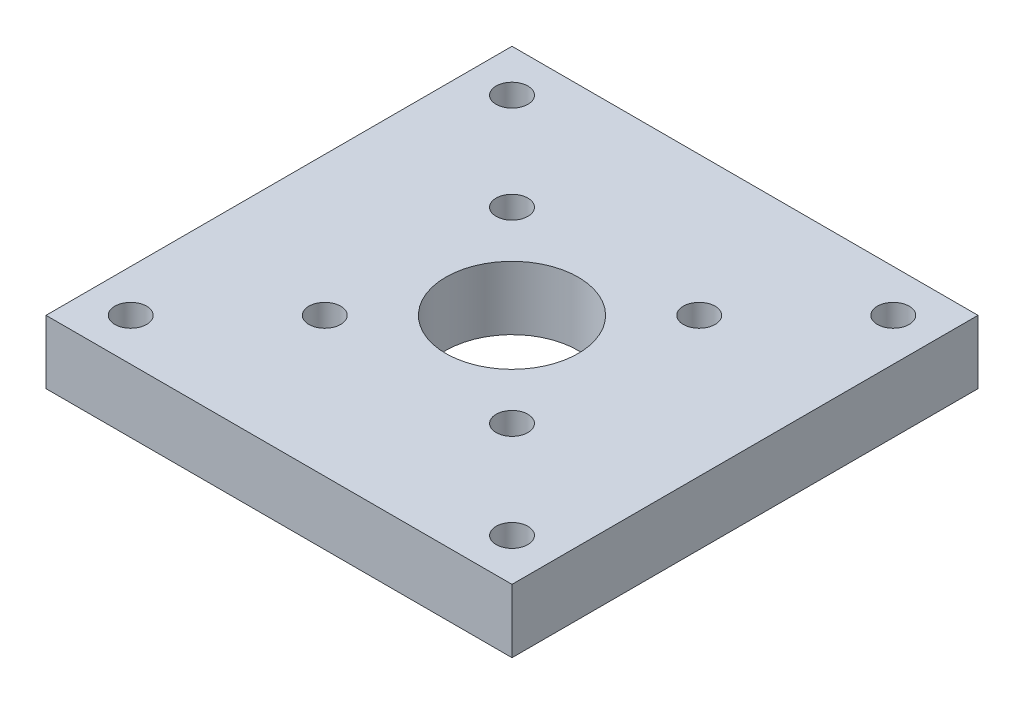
ISO-10303-21;
HEADER;
FILE_DESCRIPTION(('STEP AP214'),'2;1');
FILE_NAME('part.step','',(''),(''),'','','');
FILE_SCHEMA(('AUTOMOTIVE_DESIGN { 1 0 10303 214 1 1 1 1 }'));
ENDSEC;
DATA;
#1=APPLICATION_CONTEXT('core data for automotive mechanical design processes');
#2=APPLICATION_PROTOCOL_DEFINITION('international standard','automotive_design',2000,#1);
#3=PRODUCT_CONTEXT('',#1,'mechanical');
#4=PRODUCT('Part','Part','',(#3));
#5=PRODUCT_RELATED_PRODUCT_CATEGORY('part','',(#4));
#6=PRODUCT_DEFINITION_FORMATION('','',#4);
#7=PRODUCT_DEFINITION_CONTEXT('part definition',#1,'design');
#8=PRODUCT_DEFINITION('design','',#6,#7);
#9=PRODUCT_DEFINITION_SHAPE('','',#8);
#10=(LENGTH_UNIT() NAMED_UNIT(*) SI_UNIT(.MILLI.,.METRE.));
#11=(NAMED_UNIT(*) PLANE_ANGLE_UNIT() SI_UNIT($,.RADIAN.));
#12=(NAMED_UNIT(*) SI_UNIT($,.STERADIAN.) SOLID_ANGLE_UNIT());
#13=UNCERTAINTY_MEASURE_WITH_UNIT(LENGTH_MEASURE(1.E-05),#10,'distance_accuracy_value','');
#14=(GEOMETRIC_REPRESENTATION_CONTEXT(3) GLOBAL_UNCERTAINTY_ASSIGNED_CONTEXT((#13)) GLOBAL_UNIT_ASSIGNED_CONTEXT((#10,
#11,#12)) REPRESENTATION_CONTEXT('',''));
#15=CARTESIAN_POINT('',(0.,0.,0.));
#16=DIRECTION('',(0.,0.,1.));
#17=DIRECTION('',(1.,0.,0.));
#18=AXIS2_PLACEMENT_3D('',#15,#16,#17);
#19=CARTESIAN_POINT('',(0.,0.,0.));
#20=DIRECTION('',(0.,1.,0.));
#21=DIRECTION('',(1.,0.,0.));
#22=AXIS2_PLACEMENT_3D('',#19,#20,#21);
#23=PLANE('',#22);
#24=CARTESIAN_POINT('',(18.,0.,-18.));
#25=DIRECTION('',(0.,-1.,0.));
#26=DIRECTION('',(1.,0.,0.));
#27=AXIS2_PLACEMENT_3D('',#24,#25,#26);
#28=CIRCLE('',#27,1.5);
#29=CARTESIAN_POINT('',(16.5,0.,-18.));
#30=VERTEX_POINT('',#29);
#31=EDGE_CURVE('E154',#30,#30,#28,.T.);
#32=ORIENTED_EDGE('',*,*,#31,.F.);
#33=EDGE_LOOP('',(#32));
#34=FACE_BOUND('',#33,.T.);
#35=CARTESIAN_POINT('',(-18.,0.,-18.));
#36=DIRECTION('',(0.,-1.,0.));
#37=DIRECTION('',(1.,0.,0.));
#38=AXIS2_PLACEMENT_3D('',#35,#36,#37);
#39=CIRCLE('',#38,1.5);
#40=CARTESIAN_POINT('',(-19.5,0.,-18.));
#41=VERTEX_POINT('',#40);
#42=EDGE_CURVE('E179',#41,#41,#39,.T.);
#43=ORIENTED_EDGE('',*,*,#42,.F.);
#44=EDGE_LOOP('',(#43));
#45=FACE_BOUND('',#44,.T.);
#46=CARTESIAN_POINT('',(-18.,0.,18.));
#47=DIRECTION('',(0.,-1.,0.));
#48=DIRECTION('',(1.,0.,0.));
#49=AXIS2_PLACEMENT_3D('',#46,#47,#48);
#50=CIRCLE('',#49,1.5);
#51=CARTESIAN_POINT('',(-19.5,0.,18.));
#52=VERTEX_POINT('',#51);
#53=EDGE_CURVE('E131',#52,#52,#50,.T.);
#54=ORIENTED_EDGE('',*,*,#53,.F.);
#55=EDGE_LOOP('',(#54));
#56=FACE_BOUND('',#55,.T.);
#57=CARTESIAN_POINT('',(-8.83883476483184,0.,-8.83883476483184));
#58=DIRECTION('',(0.,-1.,0.));
#59=DIRECTION('',(1.,0.,0.));
#60=AXIS2_PLACEMENT_3D('',#57,#58,#59);
#61=CIRCLE('',#60,1.5);
#62=CARTESIAN_POINT('',(-10.3388347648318,0.,-8.83883476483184));
#63=VERTEX_POINT('',#62);
#64=EDGE_CURVE('E158',#63,#63,#61,.T.);
#65=ORIENTED_EDGE('',*,*,#64,.F.);
#66=EDGE_LOOP('',(#65));
#67=FACE_BOUND('',#66,.T.);
#68=CARTESIAN_POINT('',(-8.83883476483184,0.,8.83883476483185));
#69=DIRECTION('',(0.,-1.,0.));
#70=DIRECTION('',(1.,0.,0.));
#71=AXIS2_PLACEMENT_3D('',#68,#69,#70);
#72=CIRCLE('',#71,1.5);
#73=CARTESIAN_POINT('',(-10.3388347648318,0.,8.83883476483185));
#74=VERTEX_POINT('',#73);
#75=EDGE_CURVE('E189',#74,#74,#72,.T.);
#76=ORIENTED_EDGE('',*,*,#75,.F.);
#77=EDGE_LOOP('',(#76));
#78=FACE_BOUND('',#77,.T.);
#79=CARTESIAN_POINT('',(8.83883476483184,0.,8.83883476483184));
#80=DIRECTION('',(0.,-1.,0.));
#81=DIRECTION('',(1.,0.,0.));
#82=AXIS2_PLACEMENT_3D('',#79,#80,#81);
#83=CIRCLE('',#82,1.5);
#84=CARTESIAN_POINT('',(7.33883476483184,0.,8.83883476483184));
#85=VERTEX_POINT('',#84);
#86=EDGE_CURVE('E465',#85,#85,#83,.T.);
#87=ORIENTED_EDGE('',*,*,#86,.F.);
#88=EDGE_LOOP('',(#87));
#89=FACE_BOUND('',#88,.T.);
#90=CARTESIAN_POINT('',(8.83883476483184,0.,-8.83883476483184));
#91=DIRECTION('',(0.,-1.,0.));
#92=DIRECTION('',(1.,0.,0.));
#93=AXIS2_PLACEMENT_3D('',#90,#91,#92);
#94=CIRCLE('',#93,1.5);
#95=CARTESIAN_POINT('',(7.33883476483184,0.,-8.83883476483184));
#96=VERTEX_POINT('',#95);
#97=EDGE_CURVE('E198',#96,#96,#94,.T.);
#98=ORIENTED_EDGE('',*,*,#97,.F.);
#99=EDGE_LOOP('',(#98));
#100=FACE_BOUND('',#99,.T.);
#101=CARTESIAN_POINT('',(0.,0.,0.));
#102=DIRECTION('',(0.,-1.,0.));
#103=DIRECTION('',(1.,0.,0.));
#104=AXIS2_PLACEMENT_3D('',#101,#102,#103);
#105=CIRCLE('',#104,6.25);
#106=CARTESIAN_POINT('',(-6.25,0.,0.));
#107=VERTEX_POINT('',#106);
#108=EDGE_CURVE('E170',#107,#107,#105,.T.);
#109=ORIENTED_EDGE('',*,*,#108,.F.);
#110=EDGE_LOOP('',(#109));
#111=FACE_BOUND('',#110,.T.);
#112=CARTESIAN_POINT('',(18.,0.,18.));
#113=DIRECTION('',(0.,-1.,0.));
#114=DIRECTION('',(1.,0.,0.));
#115=AXIS2_PLACEMENT_3D('',#112,#113,#114);
#116=CIRCLE('',#115,1.5);
#117=CARTESIAN_POINT('',(16.5,0.,18.));
#118=VERTEX_POINT('',#117);
#119=EDGE_CURVE('E183',#118,#118,#116,.T.);
#120=ORIENTED_EDGE('',*,*,#119,.F.);
#121=EDGE_LOOP('',(#120));
#122=FACE_BOUND('',#121,.T.);
#123=DIRECTION('',(0.,0.,-1.));
#124=VECTOR('',#123,1.);
#125=CARTESIAN_POINT('',(22.,0.,22.));
#126=LINE('',#125,#124);
#127=CARTESIAN_POINT('',(22.,0.,22.));
#128=VERTEX_POINT('',#127);
#129=CARTESIAN_POINT('',(22.,0.,-22.));
#130=VERTEX_POINT('',#129);
#131=EDGE_CURVE('E28',#128,#130,#126,.T.);
#132=ORIENTED_EDGE('',*,*,#131,.F.);
#133=DIRECTION('',(1.,0.,0.));
#134=VECTOR('',#133,1.);
#135=CARTESIAN_POINT('',(-22.,0.,22.));
#136=LINE('',#135,#134);
#137=CARTESIAN_POINT('',(-22.,0.,22.));
#138=VERTEX_POINT('',#137);
#139=EDGE_CURVE('E21',#138,#128,#136,.T.);
#140=ORIENTED_EDGE('',*,*,#139,.F.);
#141=DIRECTION('',(0.,0.,1.));
#142=VECTOR('',#141,1.);
#143=CARTESIAN_POINT('',(-22.,0.,-22.));
#144=LINE('',#143,#142);
#145=CARTESIAN_POINT('',(-22.,0.,-22.));
#146=VERTEX_POINT('',#145);
#147=EDGE_CURVE('E232',#146,#138,#144,.T.);
#148=ORIENTED_EDGE('',*,*,#147,.F.);
#149=DIRECTION('',(-1.,0.,0.));
#150=VECTOR('',#149,1.);
#151=CARTESIAN_POINT('',(22.,0.,-22.));
#152=LINE('',#151,#150);
#153=EDGE_CURVE('E208',#130,#146,#152,.T.);
#154=ORIENTED_EDGE('',*,*,#153,.F.);
#155=EDGE_LOOP('',(#132,#140,#148,#154));
#156=FACE_BOUND('',#155,.T.);
#157=ADVANCED_FACE('F17',(#34,#45,#56,#67,#78,#89,#100,#111,#122,#156),#23,.F.);
#158=CARTESIAN_POINT('',(0.,6.,0.));
#159=DIRECTION('',(0.,1.,0.));
#160=DIRECTION('',(1.,0.,0.));
#161=AXIS2_PLACEMENT_3D('',#158,#159,#160);
#162=PLANE('',#161);
#163=CARTESIAN_POINT('',(18.,6.,-18.));
#164=DIRECTION('',(0.,-1.,0.));
#165=DIRECTION('',(1.,0.,0.));
#166=AXIS2_PLACEMENT_3D('',#163,#164,#165);
#167=CIRCLE('',#166,1.5);
#168=CARTESIAN_POINT('',(16.5,6.,-18.));
#169=VERTEX_POINT('',#168);
#170=EDGE_CURVE('E162',#169,#169,#167,.T.);
#171=ORIENTED_EDGE('',*,*,#170,.T.);
#172=EDGE_LOOP('',(#171));
#173=FACE_BOUND('',#172,.T.);
#174=CARTESIAN_POINT('',(-18.,6.,-18.));
#175=DIRECTION('',(0.,-1.,0.));
#176=DIRECTION('',(1.,0.,0.));
#177=AXIS2_PLACEMENT_3D('',#174,#175,#176);
#178=CIRCLE('',#177,1.5);
#179=CARTESIAN_POINT('',(-19.5,6.,-18.));
#180=VERTEX_POINT('',#179);
#181=EDGE_CURVE('E156',#180,#180,#178,.T.);
#182=ORIENTED_EDGE('',*,*,#181,.T.);
#183=EDGE_LOOP('',(#182));
#184=FACE_BOUND('',#183,.T.);
#185=CARTESIAN_POINT('',(-18.,6.,18.));
#186=DIRECTION('',(0.,-1.,0.));
#187=DIRECTION('',(1.,0.,0.));
#188=AXIS2_PLACEMENT_3D('',#185,#186,#187);
#189=CIRCLE('',#188,1.5);
#190=CARTESIAN_POINT('',(-19.5,6.,18.));
#191=VERTEX_POINT('',#190);
#192=EDGE_CURVE('E148',#191,#191,#189,.T.);
#193=ORIENTED_EDGE('',*,*,#192,.T.);
#194=EDGE_LOOP('',(#193));
#195=FACE_BOUND('',#194,.T.);
#196=CARTESIAN_POINT('',(-8.83883476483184,6.,-8.83883476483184));
#197=DIRECTION('',(0.,-1.,0.));
#198=DIRECTION('',(1.,0.,0.));
#199=AXIS2_PLACEMENT_3D('',#196,#197,#198);
#200=CIRCLE('',#199,1.5);
#201=CARTESIAN_POINT('',(-10.3388347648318,6.,-8.83883476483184));
#202=VERTEX_POINT('',#201);
#203=EDGE_CURVE('E138',#202,#202,#200,.T.);
#204=ORIENTED_EDGE('',*,*,#203,.T.);
#205=EDGE_LOOP('',(#204));
#206=FACE_BOUND('',#205,.T.);
#207=CARTESIAN_POINT('',(-8.83883476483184,6.,8.83883476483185));
#208=DIRECTION('',(0.,-1.,0.));
#209=DIRECTION('',(1.,0.,0.));
#210=AXIS2_PLACEMENT_3D('',#207,#208,#209);
#211=CIRCLE('',#210,1.5);
#212=CARTESIAN_POINT('',(-10.3388347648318,6.,8.83883476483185));
#213=VERTEX_POINT('',#212);
#214=EDGE_CURVE('E161',#213,#213,#211,.T.);
#215=ORIENTED_EDGE('',*,*,#214,.T.);
#216=EDGE_LOOP('',(#215));
#217=FACE_BOUND('',#216,.T.);
#218=CARTESIAN_POINT('',(8.83883476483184,6.,8.83883476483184));
#219=DIRECTION('',(0.,-1.,0.));
#220=DIRECTION('',(1.,0.,0.));
#221=AXIS2_PLACEMENT_3D('',#218,#219,#220);
#222=CIRCLE('',#221,1.5);
#223=CARTESIAN_POINT('',(7.33883476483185,6.,8.83883476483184));
#224=VERTEX_POINT('',#223);
#225=EDGE_CURVE('E192',#224,#224,#222,.T.);
#226=ORIENTED_EDGE('',*,*,#225,.T.);
#227=EDGE_LOOP('',(#226));
#228=FACE_BOUND('',#227,.T.);
#229=CARTESIAN_POINT('',(8.83883476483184,6.,-8.83883476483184));
#230=DIRECTION('',(0.,-1.,0.));
#231=DIRECTION('',(1.,0.,0.));
#232=AXIS2_PLACEMENT_3D('',#229,#230,#231);
#233=CIRCLE('',#232,1.5);
#234=CARTESIAN_POINT('',(7.33883476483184,6.,-8.83883476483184));
#235=VERTEX_POINT('',#234);
#236=EDGE_CURVE('E152',#235,#235,#233,.T.);
#237=ORIENTED_EDGE('',*,*,#236,.T.);
#238=EDGE_LOOP('',(#237));
#239=FACE_BOUND('',#238,.T.);
#240=CARTESIAN_POINT('',(0.,6.,0.));
#241=DIRECTION('',(0.,-1.,0.));
#242=DIRECTION('',(1.,0.,0.));
#243=AXIS2_PLACEMENT_3D('',#240,#241,#242);
#244=CIRCLE('',#243,6.25);
#245=CARTESIAN_POINT('',(-6.25,6.,0.));
#246=VERTEX_POINT('',#245);
#247=EDGE_CURVE('E171',#246,#246,#244,.T.);
#248=ORIENTED_EDGE('',*,*,#247,.T.);
#249=EDGE_LOOP('',(#248));
#250=FACE_BOUND('',#249,.T.);
#251=CARTESIAN_POINT('',(18.,6.,18.));
#252=DIRECTION('',(0.,-1.,0.));
#253=DIRECTION('',(1.,0.,0.));
#254=AXIS2_PLACEMENT_3D('',#251,#252,#253);
#255=CIRCLE('',#254,1.5);
#256=CARTESIAN_POINT('',(16.5,6.,18.));
#257=VERTEX_POINT('',#256);
#258=EDGE_CURVE('E253',#257,#257,#255,.T.);
#259=ORIENTED_EDGE('',*,*,#258,.T.);
#260=EDGE_LOOP('',(#259));
#261=FACE_BOUND('',#260,.T.);
#262=DIRECTION('',(0.,0.,-1.));
#263=VECTOR('',#262,1.);
#264=CARTESIAN_POINT('',(22.,6.,22.));
#265=LINE('',#264,#263);
#266=CARTESIAN_POINT('',(22.,6.,22.));
#267=VERTEX_POINT('',#266);
#268=CARTESIAN_POINT('',(22.,6.,-22.));
#269=VERTEX_POINT('',#268);
#270=EDGE_CURVE('E11',#267,#269,#265,.T.);
#271=ORIENTED_EDGE('',*,*,#270,.T.);
#272=DIRECTION('',(-1.,0.,0.));
#273=VECTOR('',#272,1.);
#274=CARTESIAN_POINT('',(22.,6.,-22.));
#275=LINE('',#274,#273);
#276=CARTESIAN_POINT('',(-22.,6.,-22.));
#277=VERTEX_POINT('',#276);
#278=EDGE_CURVE('E210',#269,#277,#275,.T.);
#279=ORIENTED_EDGE('',*,*,#278,.T.);
#280=DIRECTION('',(0.,0.,1.));
#281=VECTOR('',#280,1.);
#282=CARTESIAN_POINT('',(-22.,6.,-22.));
#283=LINE('',#282,#281);
#284=CARTESIAN_POINT('',(-22.,6.,22.));
#285=VERTEX_POINT('',#284);
#286=EDGE_CURVE('E209',#277,#285,#283,.T.);
#287=ORIENTED_EDGE('',*,*,#286,.T.);
#288=DIRECTION('',(1.,0.,0.));
#289=VECTOR('',#288,1.);
#290=CARTESIAN_POINT('',(-22.,6.,22.));
#291=LINE('',#290,#289);
#292=EDGE_CURVE('E199',#285,#267,#291,.T.);
#293=ORIENTED_EDGE('',*,*,#292,.T.);
#294=EDGE_LOOP('',(#271,#279,#287,#293));
#295=FACE_BOUND('',#294,.T.);
#296=ADVANCED_FACE('F226',(#173,#184,#195,#206,#217,#228,#239,#250,#261,#295),#162,.T.);
#297=CARTESIAN_POINT('',(22.,0.,22.));
#298=DIRECTION('',(1.,0.,0.));
#299=DIRECTION('',(0.,1.,0.));
#300=AXIS2_PLACEMENT_3D('',#297,#298,#299);
#301=PLANE('',#300);
#302=ORIENTED_EDGE('',*,*,#131,.T.);
#303=DIRECTION('',(0.,1.,0.));
#304=VECTOR('',#303,1.);
#305=CARTESIAN_POINT('',(22.,0.,-22.));
#306=LINE('',#305,#304);
#307=EDGE_CURVE('E181',#130,#269,#306,.T.);
#308=ORIENTED_EDGE('',*,*,#307,.T.);
#309=ORIENTED_EDGE('',*,*,#270,.F.);
#310=DIRECTION('',(0.,1.,0.));
#311=VECTOR('',#310,1.);
#312=CARTESIAN_POINT('',(22.,0.,22.));
#313=LINE('',#312,#311);
#314=EDGE_CURVE('E203',#128,#267,#313,.T.);
#315=ORIENTED_EDGE('',*,*,#314,.F.);
#316=EDGE_LOOP('',(#302,#308,#309,#315));
#317=FACE_BOUND('',#316,.T.);
#318=ADVANCED_FACE('F218',(#317),#301,.T.);
#319=CARTESIAN_POINT('',(22.,0.,-22.));
#320=DIRECTION('',(0.,0.,-1.));
#321=DIRECTION('',(-1.,0.,0.));
#322=AXIS2_PLACEMENT_3D('',#319,#320,#321);
#323=PLANE('',#322);
#324=ORIENTED_EDGE('',*,*,#153,.T.);
#325=DIRECTION('',(0.,1.,0.));
#326=VECTOR('',#325,1.);
#327=CARTESIAN_POINT('',(-22.,0.,-22.));
#328=LINE('',#327,#326);
#329=EDGE_CURVE('E204',#146,#277,#328,.T.);
#330=ORIENTED_EDGE('',*,*,#329,.T.);
#331=ORIENTED_EDGE('',*,*,#278,.F.);
#332=ORIENTED_EDGE('',*,*,#307,.F.);
#333=EDGE_LOOP('',(#324,#330,#331,#332));
#334=FACE_BOUND('',#333,.T.);
#335=ADVANCED_FACE('F223',(#334),#323,.T.);
#336=CARTESIAN_POINT('',(-22.,0.,-22.));
#337=DIRECTION('',(-1.,0.,0.));
#338=DIRECTION('',(0.,1.,0.));
#339=AXIS2_PLACEMENT_3D('',#336,#337,#338);
#340=PLANE('',#339);
#341=ORIENTED_EDGE('',*,*,#147,.T.);
#342=DIRECTION('',(0.,1.,0.));
#343=VECTOR('',#342,1.);
#344=CARTESIAN_POINT('',(-22.,0.,22.));
#345=LINE('',#344,#343);
#346=EDGE_CURVE('E202',#138,#285,#345,.T.);
#347=ORIENTED_EDGE('',*,*,#346,.T.);
#348=ORIENTED_EDGE('',*,*,#286,.F.);
#349=ORIENTED_EDGE('',*,*,#329,.F.);
#350=EDGE_LOOP('',(#341,#347,#348,#349));
#351=FACE_BOUND('',#350,.T.);
#352=ADVANCED_FACE('F236',(#351),#340,.T.);
#353=CARTESIAN_POINT('',(-22.,0.,22.));
#354=DIRECTION('',(0.,0.,1.));
#355=DIRECTION('',(1.,0.,0.));
#356=AXIS2_PLACEMENT_3D('',#353,#354,#355);
#357=PLANE('',#356);
#358=ORIENTED_EDGE('',*,*,#139,.T.);
#359=ORIENTED_EDGE('',*,*,#314,.T.);
#360=ORIENTED_EDGE('',*,*,#292,.F.);
#361=ORIENTED_EDGE('',*,*,#346,.F.);
#362=EDGE_LOOP('',(#358,#359,#360,#361));
#363=FACE_BOUND('',#362,.T.);
#364=ADVANCED_FACE('F243',(#363),#357,.T.);
#365=CARTESIAN_POINT('',(18.,0.,18.));
#366=DIRECTION('',(0.,1.,0.));
#367=DIRECTION('',(1.,0.,0.));
#368=AXIS2_PLACEMENT_3D('',#365,#366,#367);
#369=CYLINDRICAL_SURFACE('',#368,1.5);
#370=ORIENTED_EDGE('',*,*,#258,.F.);
#371=DIRECTION('',(0.,-1.,0.));
#372=VECTOR('',#371,1.);
#373=CARTESIAN_POINT('',(16.5,0.,18.));
#374=LINE('',#373,#372);
#375=EDGE_CURVE('E186',#257,#118,#374,.T.);
#376=ORIENTED_EDGE('',*,*,#375,.T.);
#377=ORIENTED_EDGE('',*,*,#119,.T.);
#378=ORIENTED_EDGE('',*,*,#375,.F.);
#379=EDGE_LOOP('',(#370,#376,#377,#378));
#380=FACE_BOUND('',#379,.T.);
#381=ADVANCED_FACE('F329',(#380),#369,.F.);
#382=CARTESIAN_POINT('',(0.,0.,0.));
#383=DIRECTION('',(0.,1.,0.));
#384=DIRECTION('',(1.,0.,0.));
#385=AXIS2_PLACEMENT_3D('',#382,#383,#384);
#386=CYLINDRICAL_SURFACE('',#385,6.25);
#387=ORIENTED_EDGE('',*,*,#247,.F.);
#388=DIRECTION('',(0.,-1.,0.));
#389=VECTOR('',#388,1.);
#390=CARTESIAN_POINT('',(-6.25,0.,0.));
#391=LINE('',#390,#389);
#392=EDGE_CURVE('E166',#246,#107,#391,.T.);
#393=ORIENTED_EDGE('',*,*,#392,.T.);
#394=ORIENTED_EDGE('',*,*,#108,.T.);
#395=ORIENTED_EDGE('',*,*,#392,.F.);
#396=EDGE_LOOP('',(#387,#393,#394,#395));
#397=FACE_BOUND('',#396,.T.);
#398=ADVANCED_FACE('F267',(#397),#386,.F.);
#399=CARTESIAN_POINT('',(8.83883476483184,0.,-8.83883476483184));
#400=DIRECTION('',(0.,1.,0.));
#401=DIRECTION('',(1.,0.,0.));
#402=AXIS2_PLACEMENT_3D('',#399,#400,#401);
#403=CYLINDRICAL_SURFACE('',#402,1.5);
#404=ORIENTED_EDGE('',*,*,#236,.F.);
#405=DIRECTION('',(0.,-1.,0.));
#406=VECTOR('',#405,1.);
#407=CARTESIAN_POINT('',(7.33883476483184,0.,-8.83883476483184));
#408=LINE('',#407,#406);
#409=EDGE_CURVE('E194',#235,#96,#408,.T.);
#410=ORIENTED_EDGE('',*,*,#409,.T.);
#411=ORIENTED_EDGE('',*,*,#97,.T.);
#412=ORIENTED_EDGE('',*,*,#409,.F.);
#413=EDGE_LOOP('',(#404,#410,#411,#412));
#414=FACE_BOUND('',#413,.T.);
#415=ADVANCED_FACE('F359',(#414),#403,.F.);
#416=CARTESIAN_POINT('',(8.83883476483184,0.,8.83883476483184));
#417=DIRECTION('',(0.,1.,0.));
#418=DIRECTION('',(1.,0.,0.));
#419=AXIS2_PLACEMENT_3D('',#416,#417,#418);
#420=CYLINDRICAL_SURFACE('',#419,1.5);
#421=ORIENTED_EDGE('',*,*,#225,.F.);
#422=DIRECTION('',(0.,-1.,0.));
#423=VECTOR('',#422,1.);
#424=CARTESIAN_POINT('',(7.33883476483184,0.,8.83883476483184));
#425=LINE('',#424,#423);
#426=EDGE_CURVE('E459',#224,#85,#425,.T.);
#427=ORIENTED_EDGE('',*,*,#426,.T.);
#428=ORIENTED_EDGE('',*,*,#86,.T.);
#429=ORIENTED_EDGE('',*,*,#426,.F.);
#430=EDGE_LOOP('',(#421,#427,#428,#429));
#431=FACE_BOUND('',#430,.T.);
#432=ADVANCED_FACE('F344',(#431),#420,.F.);
#433=CARTESIAN_POINT('',(-8.83883476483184,0.,8.83883476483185));
#434=DIRECTION('',(0.,1.,0.));
#435=DIRECTION('',(1.,0.,0.));
#436=AXIS2_PLACEMENT_3D('',#433,#434,#435);
#437=CYLINDRICAL_SURFACE('',#436,1.5);
#438=ORIENTED_EDGE('',*,*,#214,.F.);
#439=DIRECTION('',(0.,-1.,0.));
#440=VECTOR('',#439,1.);
#441=CARTESIAN_POINT('',(-10.3388347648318,0.,8.83883476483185));
#442=LINE('',#441,#440);
#443=EDGE_CURVE('E193',#213,#74,#442,.T.);
#444=ORIENTED_EDGE('',*,*,#443,.T.);
#445=ORIENTED_EDGE('',*,*,#75,.T.);
#446=ORIENTED_EDGE('',*,*,#443,.F.);
#447=EDGE_LOOP('',(#438,#444,#445,#446));
#448=FACE_BOUND('',#447,.T.);
#449=ADVANCED_FACE('F322',(#448),#437,.F.);
#450=CARTESIAN_POINT('',(-8.83883476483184,0.,-8.83883476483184));
#451=DIRECTION('',(0.,1.,0.));
#452=DIRECTION('',(1.,0.,0.));
#453=AXIS2_PLACEMENT_3D('',#450,#451,#452);
#454=CYLINDRICAL_SURFACE('',#453,1.5);
#455=ORIENTED_EDGE('',*,*,#203,.F.);
#456=DIRECTION('',(0.,-1.,0.));
#457=VECTOR('',#456,1.);
#458=CARTESIAN_POINT('',(-10.3388347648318,0.,-8.83883476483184));
#459=LINE('',#458,#457);
#460=EDGE_CURVE('E145',#202,#63,#459,.T.);
#461=ORIENTED_EDGE('',*,*,#460,.T.);
#462=ORIENTED_EDGE('',*,*,#64,.T.);
#463=ORIENTED_EDGE('',*,*,#460,.F.);
#464=EDGE_LOOP('',(#455,#461,#462,#463));
#465=FACE_BOUND('',#464,.T.);
#466=ADVANCED_FACE('F303',(#465),#454,.F.);
#467=CARTESIAN_POINT('',(-18.,0.,18.));
#468=DIRECTION('',(0.,1.,0.));
#469=DIRECTION('',(1.,0.,0.));
#470=AXIS2_PLACEMENT_3D('',#467,#468,#469);
#471=CYLINDRICAL_SURFACE('',#470,1.5);
#472=ORIENTED_EDGE('',*,*,#192,.F.);
#473=DIRECTION('',(0.,-1.,0.));
#474=VECTOR('',#473,1.);
#475=CARTESIAN_POINT('',(-19.5,0.,18.));
#476=LINE('',#475,#474);
#477=EDGE_CURVE('E134',#191,#52,#476,.T.);
#478=ORIENTED_EDGE('',*,*,#477,.T.);
#479=ORIENTED_EDGE('',*,*,#53,.T.);
#480=ORIENTED_EDGE('',*,*,#477,.F.);
#481=EDGE_LOOP('',(#472,#478,#479,#480));
#482=FACE_BOUND('',#481,.T.);
#483=ADVANCED_FACE('F133',(#482),#471,.F.);
#484=CARTESIAN_POINT('',(-18.,0.,-18.));
#485=DIRECTION('',(0.,1.,0.));
#486=DIRECTION('',(1.,0.,0.));
#487=AXIS2_PLACEMENT_3D('',#484,#485,#486);
#488=CYLINDRICAL_SURFACE('',#487,1.5);
#489=ORIENTED_EDGE('',*,*,#181,.F.);
#490=DIRECTION('',(0.,-1.,0.));
#491=VECTOR('',#490,1.);
#492=CARTESIAN_POINT('',(-19.5,0.,-18.));
#493=LINE('',#492,#491);
#494=EDGE_CURVE('E175',#180,#41,#493,.T.);
#495=ORIENTED_EDGE('',*,*,#494,.T.);
#496=ORIENTED_EDGE('',*,*,#42,.T.);
#497=ORIENTED_EDGE('',*,*,#494,.F.);
#498=EDGE_LOOP('',(#489,#495,#496,#497));
#499=FACE_BOUND('',#498,.T.);
#500=ADVANCED_FACE('F19',(#499),#488,.F.);
#501=CARTESIAN_POINT('',(18.,0.,-18.));
#502=DIRECTION('',(0.,1.,0.));
#503=DIRECTION('',(1.,0.,0.));
#504=AXIS2_PLACEMENT_3D('',#501,#502,#503);
#505=CYLINDRICAL_SURFACE('',#504,1.5);
#506=ORIENTED_EDGE('',*,*,#170,.F.);
#507=DIRECTION('',(0.,-1.,0.));
#508=VECTOR('',#507,1.);
#509=CARTESIAN_POINT('',(16.5,0.,-18.));
#510=LINE('',#509,#508);
#511=EDGE_CURVE('E157',#169,#30,#510,.T.);
#512=ORIENTED_EDGE('',*,*,#511,.T.);
#513=ORIENTED_EDGE('',*,*,#31,.T.);
#514=ORIENTED_EDGE('',*,*,#511,.F.);
#515=EDGE_LOOP('',(#506,#512,#513,#514));
#516=FACE_BOUND('',#515,.T.);
#517=ADVANCED_FACE('F292',(#516),#505,.F.);
#518=CLOSED_SHELL('',(#157,#296,#318,#335,#352,#364,#381,#398,#415,#432,#449,#466,#483,#500,#517));
#519=MANIFOLD_SOLID_BREP('B1',#518);
#520=ADVANCED_BREP_SHAPE_REPRESENTATION('',(#18,#519),#14);
#521=SHAPE_DEFINITION_REPRESENTATION(#9,#520);
ENDSEC;
END-ISO-10303-21;
